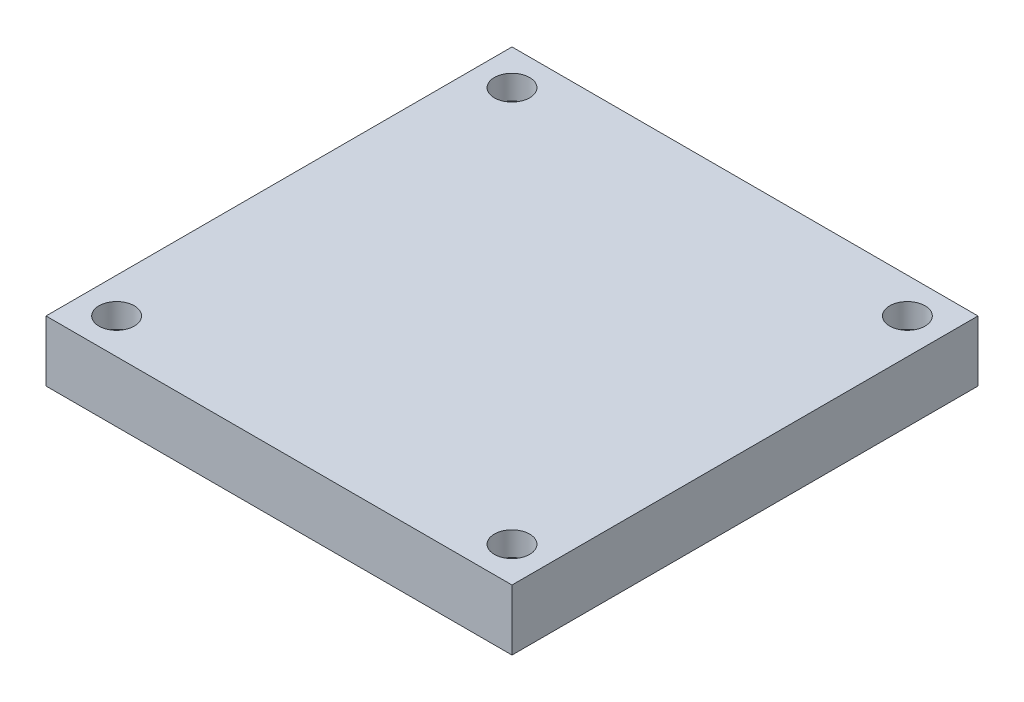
ISO-10303-21;
HEADER;
FILE_DESCRIPTION(('STEP AP214'),'2;1');
FILE_NAME('part.step','',(''),(''),'','','');
FILE_SCHEMA(('AUTOMOTIVE_DESIGN { 1 0 10303 214 1 1 1 1 }'));
ENDSEC;
DATA;
#1=APPLICATION_CONTEXT('core data for automotive mechanical design processes');
#2=APPLICATION_PROTOCOL_DEFINITION('international standard','automotive_design',2000,#1);
#3=PRODUCT_CONTEXT('',#1,'mechanical');
#4=PRODUCT('Part','Part','',(#3));
#5=PRODUCT_RELATED_PRODUCT_CATEGORY('part','',(#4));
#6=PRODUCT_DEFINITION_FORMATION('','',#4);
#7=PRODUCT_DEFINITION_CONTEXT('part definition',#1,'design');
#8=PRODUCT_DEFINITION('design','',#6,#7);
#9=PRODUCT_DEFINITION_SHAPE('','',#8);
#10=(LENGTH_UNIT() NAMED_UNIT(*) SI_UNIT(.MILLI.,.METRE.));
#11=(NAMED_UNIT(*) PLANE_ANGLE_UNIT() SI_UNIT($,.RADIAN.));
#12=(NAMED_UNIT(*) SI_UNIT($,.STERADIAN.) SOLID_ANGLE_UNIT());
#13=UNCERTAINTY_MEASURE_WITH_UNIT(LENGTH_MEASURE(1.E-05),#10,'distance_accuracy_value','');
#14=(GEOMETRIC_REPRESENTATION_CONTEXT(3) GLOBAL_UNCERTAINTY_ASSIGNED_CONTEXT((#13)) GLOBAL_UNIT_ASSIGNED_CONTEXT((#10,
#11,#12)) REPRESENTATION_CONTEXT('',''));
#15=CARTESIAN_POINT('',(0.,0.,0.));
#16=DIRECTION('',(0.,0.,1.));
#17=DIRECTION('',(1.,0.,0.));
#18=AXIS2_PLACEMENT_3D('',#15,#16,#17);
#19=CARTESIAN_POINT('',(0.,4.3,0.));
#20=DIRECTION('',(1.,0.,0.));
#21=DIRECTION('',(0.,0.,-1.));
#22=AXIS2_PLACEMENT_3D('',#19,#20,#21);
#23=PLANE('',#22);
#24=DIRECTION('',(0.,0.,1.));
#25=VECTOR('',#24,1.);
#26=CARTESIAN_POINT('',(0.,0.,0.));
#27=LINE('',#26,#25);
#28=CARTESIAN_POINT('',(0.,0.,0.));
#29=VERTEX_POINT('',#28);
#30=CARTESIAN_POINT('',(0.,0.,33.));
#31=VERTEX_POINT('',#30);
#32=EDGE_CURVE('E100',#29,#31,#27,.T.);
#33=ORIENTED_EDGE('',*,*,#32,.T.);
#34=DIRECTION('',(0.,-1.,0.));
#35=VECTOR('',#34,1.);
#36=CARTESIAN_POINT('',(0.,4.3,33.));
#37=LINE('',#36,#35);
#38=CARTESIAN_POINT('',(0.,4.3,33.));
#39=VERTEX_POINT('',#38);
#40=EDGE_CURVE('E11',#39,#31,#37,.T.);
#41=ORIENTED_EDGE('',*,*,#40,.F.);
#42=DIRECTION('',(0.,0.,1.));
#43=VECTOR('',#42,1.);
#44=CARTESIAN_POINT('',(0.,4.3,0.));
#45=LINE('',#44,#43);
#46=CARTESIAN_POINT('',(0.,4.3,0.));
#47=VERTEX_POINT('',#46);
#48=EDGE_CURVE('E88',#47,#39,#45,.T.);
#49=ORIENTED_EDGE('',*,*,#48,.F.);
#50=DIRECTION('',(0.,-1.,0.));
#51=VECTOR('',#50,1.);
#52=CARTESIAN_POINT('',(0.,4.3,0.));
#53=LINE('',#52,#51);
#54=EDGE_CURVE('E96',#47,#29,#53,.T.);
#55=ORIENTED_EDGE('',*,*,#54,.T.);
#56=EDGE_LOOP('',(#33,#41,#49,#55));
#57=FACE_BOUND('',#56,.T.);
#58=ADVANCED_FACE('F37',(#57),#23,.F.);
#59=CARTESIAN_POINT('',(0.,4.3,33.));
#60=DIRECTION('',(0.,0.,-1.));
#61=DIRECTION('',(-1.,0.,0.));
#62=AXIS2_PLACEMENT_3D('',#59,#60,#61);
#63=PLANE('',#62);
#64=DIRECTION('',(1.,0.,0.));
#65=VECTOR('',#64,1.);
#66=CARTESIAN_POINT('',(0.,0.,33.));
#67=LINE('',#66,#65);
#68=CARTESIAN_POINT('',(33.,0.,33.));
#69=VERTEX_POINT('',#68);
#70=EDGE_CURVE('E92',#31,#69,#67,.T.);
#71=ORIENTED_EDGE('',*,*,#70,.T.);
#72=DIRECTION('',(0.,-1.,0.));
#73=VECTOR('',#72,1.);
#74=CARTESIAN_POINT('',(33.,4.3,33.));
#75=LINE('',#74,#73);
#76=CARTESIAN_POINT('',(33.,4.3,33.));
#77=VERTEX_POINT('',#76);
#78=EDGE_CURVE('E45',#77,#69,#75,.T.);
#79=ORIENTED_EDGE('',*,*,#78,.F.);
#80=DIRECTION('',(1.,0.,0.));
#81=VECTOR('',#80,1.);
#82=CARTESIAN_POINT('',(0.,4.3,33.));
#83=LINE('',#82,#81);
#84=EDGE_CURVE('E83',#39,#77,#83,.T.);
#85=ORIENTED_EDGE('',*,*,#84,.F.);
#86=ORIENTED_EDGE('',*,*,#40,.T.);
#87=EDGE_LOOP('',(#71,#79,#85,#86));
#88=FACE_BOUND('',#87,.T.);
#89=ADVANCED_FACE('F91',(#88),#63,.F.);
#90=CARTESIAN_POINT('',(33.,4.3,0.));
#91=DIRECTION('',(-1.,0.,0.));
#92=DIRECTION('',(0.,0.,1.));
#93=AXIS2_PLACEMENT_3D('',#90,#91,#92);
#94=PLANE('',#93);
#95=DIRECTION('',(0.,0.,-1.));
#96=VECTOR('',#95,1.);
#97=CARTESIAN_POINT('',(33.,0.,0.));
#98=LINE('',#97,#96);
#99=CARTESIAN_POINT('',(33.,0.,0.));
#100=VERTEX_POINT('',#99);
#101=EDGE_CURVE('E70',#69,#100,#98,.T.);
#102=ORIENTED_EDGE('',*,*,#101,.T.);
#103=DIRECTION('',(0.,-1.,0.));
#104=VECTOR('',#103,1.);
#105=CARTESIAN_POINT('',(33.,4.3,0.));
#106=LINE('',#105,#104);
#107=CARTESIAN_POINT('',(33.,4.3,0.));
#108=VERTEX_POINT('',#107);
#109=EDGE_CURVE('E93',#108,#100,#106,.T.);
#110=ORIENTED_EDGE('',*,*,#109,.F.);
#111=DIRECTION('',(0.,0.,-1.));
#112=VECTOR('',#111,1.);
#113=CARTESIAN_POINT('',(33.,4.3,0.));
#114=LINE('',#113,#112);
#115=EDGE_CURVE('E86',#77,#108,#114,.T.);
#116=ORIENTED_EDGE('',*,*,#115,.F.);
#117=ORIENTED_EDGE('',*,*,#78,.T.);
#118=EDGE_LOOP('',(#102,#110,#116,#117));
#119=FACE_BOUND('',#118,.T.);
#120=ADVANCED_FACE('F94',(#119),#94,.F.);
#121=CARTESIAN_POINT('',(0.,4.3,0.));
#122=DIRECTION('',(0.,0.,1.));
#123=DIRECTION('',(1.,0.,0.));
#124=AXIS2_PLACEMENT_3D('',#121,#122,#123);
#125=PLANE('',#124);
#126=DIRECTION('',(-1.,0.,0.));
#127=VECTOR('',#126,1.);
#128=CARTESIAN_POINT('',(0.,0.,0.));
#129=LINE('',#128,#127);
#130=EDGE_CURVE('E76',#100,#29,#129,.T.);
#131=ORIENTED_EDGE('',*,*,#130,.T.);
#132=ORIENTED_EDGE('',*,*,#54,.F.);
#133=DIRECTION('',(-1.,0.,0.));
#134=VECTOR('',#133,1.);
#135=CARTESIAN_POINT('',(0.,4.3,0.));
#136=LINE('',#135,#134);
#137=EDGE_CURVE('E53',#108,#47,#136,.T.);
#138=ORIENTED_EDGE('',*,*,#137,.F.);
#139=ORIENTED_EDGE('',*,*,#109,.T.);
#140=EDGE_LOOP('',(#131,#132,#138,#139));
#141=FACE_BOUND('',#140,.T.);
#142=ADVANCED_FACE('F108',(#141),#125,.F.);
#143=CARTESIAN_POINT('',(0.,4.3,33.));
#144=DIRECTION('',(0.,1.,0.));
#145=DIRECTION('',(0.,0.,1.));
#146=AXIS2_PLACEMENT_3D('',#143,#144,#145);
#147=PLANE('',#146);
#148=CARTESIAN_POINT('',(30.5,4.3,30.5));
#149=DIRECTION('',(0.,-1.,0.));
#150=DIRECTION('',(0.,0.,-1.));
#151=AXIS2_PLACEMENT_3D('',#148,#149,#150);
#152=CIRCLE('',#151,1.25);
#153=CARTESIAN_POINT('',(30.5,4.3,29.25));
#154=VERTEX_POINT('',#153);
#155=EDGE_CURVE('E149',#154,#154,#152,.T.);
#156=ORIENTED_EDGE('',*,*,#155,.T.);
#157=EDGE_LOOP('',(#156));
#158=FACE_BOUND('',#157,.T.);
#159=CARTESIAN_POINT('',(2.50000000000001,4.3,30.5));
#160=DIRECTION('',(0.,-1.,0.));
#161=DIRECTION('',(0.,0.,-1.));
#162=AXIS2_PLACEMENT_3D('',#159,#160,#161);
#163=CIRCLE('',#162,1.25);
#164=CARTESIAN_POINT('',(2.50000000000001,4.3,29.25));
#165=VERTEX_POINT('',#164);
#166=EDGE_CURVE('E137',#165,#165,#163,.T.);
#167=ORIENTED_EDGE('',*,*,#166,.T.);
#168=EDGE_LOOP('',(#167));
#169=FACE_BOUND('',#168,.T.);
#170=CARTESIAN_POINT('',(2.5,4.3,2.50000000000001));
#171=DIRECTION('',(0.,-1.,0.));
#172=DIRECTION('',(0.,0.,-1.));
#173=AXIS2_PLACEMENT_3D('',#170,#171,#172);
#174=CIRCLE('',#173,1.25);
#175=CARTESIAN_POINT('',(2.5,4.3,1.25000000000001));
#176=VERTEX_POINT('',#175);
#177=EDGE_CURVE('E125',#176,#176,#174,.T.);
#178=ORIENTED_EDGE('',*,*,#177,.T.);
#179=EDGE_LOOP('',(#178));
#180=FACE_BOUND('',#179,.T.);
#181=CARTESIAN_POINT('',(30.5,4.3,2.5));
#182=DIRECTION('',(0.,-1.,0.));
#183=DIRECTION('',(0.,0.,-1.));
#184=AXIS2_PLACEMENT_3D('',#181,#182,#183);
#185=CIRCLE('',#184,1.25);
#186=CARTESIAN_POINT('',(30.5,4.3,1.25));
#187=VERTEX_POINT('',#186);
#188=EDGE_CURVE('E103',#187,#187,#185,.T.);
#189=ORIENTED_EDGE('',*,*,#188,.T.);
#190=EDGE_LOOP('',(#189));
#191=FACE_BOUND('',#190,.T.);
#192=ORIENTED_EDGE('',*,*,#48,.T.);
#193=ORIENTED_EDGE('',*,*,#84,.T.);
#194=ORIENTED_EDGE('',*,*,#115,.T.);
#195=ORIENTED_EDGE('',*,*,#137,.T.);
#196=EDGE_LOOP('',(#192,#193,#194,#195));
#197=FACE_BOUND('',#196,.T.);
#198=ADVANCED_FACE('F84',(#158,#169,#180,#191,#197),#147,.T.);
#199=CARTESIAN_POINT('',(0.,0.,33.));
#200=DIRECTION('',(0.,1.,0.));
#201=DIRECTION('',(0.,0.,1.));
#202=AXIS2_PLACEMENT_3D('',#199,#200,#201);
#203=PLANE('',#202);
#204=CARTESIAN_POINT('',(30.5,0.,30.5));
#205=DIRECTION('',(0.,-1.,0.));
#206=DIRECTION('',(0.,0.,-1.));
#207=AXIS2_PLACEMENT_3D('',#204,#205,#206);
#208=CIRCLE('',#207,2.1);
#209=CARTESIAN_POINT('',(30.5,0.,28.4));
#210=VERTEX_POINT('',#209);
#211=EDGE_CURVE('E158',#210,#210,#208,.T.);
#212=ORIENTED_EDGE('',*,*,#211,.F.);
#213=EDGE_LOOP('',(#212));
#214=FACE_BOUND('',#213,.T.);
#215=CARTESIAN_POINT('',(2.50000000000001,0.,30.5));
#216=DIRECTION('',(0.,-1.,0.));
#217=DIRECTION('',(0.,0.,-1.));
#218=AXIS2_PLACEMENT_3D('',#215,#216,#217);
#219=CIRCLE('',#218,2.1);
#220=CARTESIAN_POINT('',(2.50000000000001,0.,28.4));
#221=VERTEX_POINT('',#220);
#222=EDGE_CURVE('E146',#221,#221,#219,.T.);
#223=ORIENTED_EDGE('',*,*,#222,.F.);
#224=EDGE_LOOP('',(#223));
#225=FACE_BOUND('',#224,.T.);
#226=CARTESIAN_POINT('',(2.5,0.,2.50000000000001));
#227=DIRECTION('',(0.,-1.,0.));
#228=DIRECTION('',(0.,0.,-1.));
#229=AXIS2_PLACEMENT_3D('',#226,#227,#228);
#230=CIRCLE('',#229,2.1);
#231=CARTESIAN_POINT('',(2.5,0.,0.400000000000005));
#232=VERTEX_POINT('',#231);
#233=EDGE_CURVE('E134',#232,#232,#230,.T.);
#234=ORIENTED_EDGE('',*,*,#233,.F.);
#235=EDGE_LOOP('',(#234));
#236=FACE_BOUND('',#235,.T.);
#237=CARTESIAN_POINT('',(30.5,0.,2.5));
#238=DIRECTION('',(0.,-1.,0.));
#239=DIRECTION('',(0.,0.,-1.));
#240=AXIS2_PLACEMENT_3D('',#237,#238,#239);
#241=CIRCLE('',#240,2.1);
#242=CARTESIAN_POINT('',(30.5,0.,0.400000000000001));
#243=VERTEX_POINT('',#242);
#244=EDGE_CURVE('E122',#243,#243,#241,.T.);
#245=ORIENTED_EDGE('',*,*,#244,.F.);
#246=EDGE_LOOP('',(#245));
#247=FACE_BOUND('',#246,.T.);
#248=ORIENTED_EDGE('',*,*,#32,.F.);
#249=ORIENTED_EDGE('',*,*,#130,.F.);
#250=ORIENTED_EDGE('',*,*,#101,.F.);
#251=ORIENTED_EDGE('',*,*,#70,.F.);
#252=EDGE_LOOP('',(#248,#249,#250,#251));
#253=FACE_BOUND('',#252,.T.);
#254=ADVANCED_FACE('F111',(#214,#225,#236,#247,#253),#203,.F.);
#255=CARTESIAN_POINT('',(30.5,0.,2.5));
#256=DIRECTION('',(0.,-1.,0.));
#257=DIRECTION('',(0.,0.,-1.));
#258=AXIS2_PLACEMENT_3D('',#255,#256,#257);
#259=CYLINDRICAL_SURFACE('',#258,1.25);
#260=ORIENTED_EDGE('',*,*,#188,.F.);
#261=EDGE_LOOP('',(#260));
#262=FACE_BOUND('',#261,.T.);
#263=CARTESIAN_POINT('',(30.5,2.6,2.5));
#264=DIRECTION('',(0.,-1.,0.));
#265=DIRECTION('',(0.,0.,-1.));
#266=AXIS2_PLACEMENT_3D('',#263,#264,#265);
#267=CIRCLE('',#266,1.25);
#268=CARTESIAN_POINT('',(30.5,2.6,1.25));
#269=VERTEX_POINT('',#268);
#270=EDGE_CURVE('E116',#269,#269,#267,.T.);
#271=ORIENTED_EDGE('',*,*,#270,.T.);
#272=EDGE_LOOP('',(#271));
#273=FACE_BOUND('',#272,.T.);
#274=ADVANCED_FACE('F166',(#262,#273),#259,.F.);
#275=CARTESIAN_POINT('',(31.75,2.6,2.5));
#276=DIRECTION('',(0.,1.,0.));
#277=DIRECTION('',(0.,0.,1.));
#278=AXIS2_PLACEMENT_3D('',#275,#276,#277);
#279=PLANE('',#278);
#280=ORIENTED_EDGE('',*,*,#270,.F.);
#281=EDGE_LOOP('',(#280));
#282=FACE_BOUND('',#281,.T.);
#283=CARTESIAN_POINT('',(30.5,2.6,2.5));
#284=DIRECTION('',(0.,-1.,0.));
#285=DIRECTION('',(0.,0.,-1.));
#286=AXIS2_PLACEMENT_3D('',#283,#284,#285);
#287=CIRCLE('',#286,2.1);
#288=CARTESIAN_POINT('',(30.5,2.6,0.400000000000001));
#289=VERTEX_POINT('',#288);
#290=EDGE_CURVE('E119',#289,#289,#287,.T.);
#291=ORIENTED_EDGE('',*,*,#290,.T.);
#292=EDGE_LOOP('',(#291));
#293=FACE_BOUND('',#292,.T.);
#294=ADVANCED_FACE('F177',(#282,#293),#279,.F.);
#295=CARTESIAN_POINT('',(30.5,0.,2.5));
#296=DIRECTION('',(0.,-1.,0.));
#297=DIRECTION('',(0.,0.,-1.));
#298=AXIS2_PLACEMENT_3D('',#295,#296,#297);
#299=CYLINDRICAL_SURFACE('',#298,2.1);
#300=ORIENTED_EDGE('',*,*,#290,.F.);
#301=EDGE_LOOP('',(#300));
#302=FACE_BOUND('',#301,.T.);
#303=ORIENTED_EDGE('',*,*,#244,.T.);
#304=EDGE_LOOP('',(#303));
#305=FACE_BOUND('',#304,.T.);
#306=ADVANCED_FACE('F174',(#302,#305),#299,.F.);
#307=CARTESIAN_POINT('',(2.5,0.,2.50000000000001));
#308=DIRECTION('',(0.,-1.,0.));
#309=DIRECTION('',(0.,0.,-1.));
#310=AXIS2_PLACEMENT_3D('',#307,#308,#309);
#311=CYLINDRICAL_SURFACE('',#310,1.25);
#312=ORIENTED_EDGE('',*,*,#177,.F.);
#313=EDGE_LOOP('',(#312));
#314=FACE_BOUND('',#313,.T.);
#315=CARTESIAN_POINT('',(2.5,2.6,2.50000000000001));
#316=DIRECTION('',(0.,-1.,0.));
#317=DIRECTION('',(0.,0.,-1.));
#318=AXIS2_PLACEMENT_3D('',#315,#316,#317);
#319=CIRCLE('',#318,1.25);
#320=CARTESIAN_POINT('',(2.5,2.6,1.25000000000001));
#321=VERTEX_POINT('',#320);
#322=EDGE_CURVE('E128',#321,#321,#319,.T.);
#323=ORIENTED_EDGE('',*,*,#322,.T.);
#324=EDGE_LOOP('',(#323));
#325=FACE_BOUND('',#324,.T.);
#326=ADVANCED_FACE('F176',(#314,#325),#311,.F.);
#327=CARTESIAN_POINT('',(3.75,2.6,2.50000000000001));
#328=DIRECTION('',(0.,1.,0.));
#329=DIRECTION('',(0.,0.,1.));
#330=AXIS2_PLACEMENT_3D('',#327,#328,#329);
#331=PLANE('',#330);
#332=ORIENTED_EDGE('',*,*,#322,.F.);
#333=EDGE_LOOP('',(#332));
#334=FACE_BOUND('',#333,.T.);
#335=CARTESIAN_POINT('',(2.5,2.6,2.50000000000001));
#336=DIRECTION('',(0.,-1.,0.));
#337=DIRECTION('',(0.,0.,-1.));
#338=AXIS2_PLACEMENT_3D('',#335,#336,#337);
#339=CIRCLE('',#338,2.1);
#340=CARTESIAN_POINT('',(2.5,2.6,0.400000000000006));
#341=VERTEX_POINT('',#340);
#342=EDGE_CURVE('E131',#341,#341,#339,.T.);
#343=ORIENTED_EDGE('',*,*,#342,.T.);
#344=EDGE_LOOP('',(#343));
#345=FACE_BOUND('',#344,.T.);
#346=ADVANCED_FACE('F184',(#334,#345),#331,.F.);
#347=CARTESIAN_POINT('',(2.5,0.,2.50000000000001));
#348=DIRECTION('',(0.,-1.,0.));
#349=DIRECTION('',(0.,0.,-1.));
#350=AXIS2_PLACEMENT_3D('',#347,#348,#349);
#351=CYLINDRICAL_SURFACE('',#350,2.1);
#352=ORIENTED_EDGE('',*,*,#342,.F.);
#353=EDGE_LOOP('',(#352));
#354=FACE_BOUND('',#353,.T.);
#355=ORIENTED_EDGE('',*,*,#233,.T.);
#356=EDGE_LOOP('',(#355));
#357=FACE_BOUND('',#356,.T.);
#358=ADVANCED_FACE('F238',(#354,#357),#351,.F.);
#359=CARTESIAN_POINT('',(2.50000000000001,0.,30.5));
#360=DIRECTION('',(0.,-1.,0.));
#361=DIRECTION('',(0.,0.,-1.));
#362=AXIS2_PLACEMENT_3D('',#359,#360,#361);
#363=CYLINDRICAL_SURFACE('',#362,1.25);
#364=ORIENTED_EDGE('',*,*,#166,.F.);
#365=EDGE_LOOP('',(#364));
#366=FACE_BOUND('',#365,.T.);
#367=CARTESIAN_POINT('',(2.50000000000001,2.6,30.5));
#368=DIRECTION('',(0.,-1.,0.));
#369=DIRECTION('',(0.,0.,-1.));
#370=AXIS2_PLACEMENT_3D('',#367,#368,#369);
#371=CIRCLE('',#370,1.25);
#372=CARTESIAN_POINT('',(2.50000000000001,2.6,29.25));
#373=VERTEX_POINT('',#372);
#374=EDGE_CURVE('E140',#373,#373,#371,.T.);
#375=ORIENTED_EDGE('',*,*,#374,.T.);
#376=EDGE_LOOP('',(#375));
#377=FACE_BOUND('',#376,.T.);
#378=ADVANCED_FACE('F248',(#366,#377),#363,.F.);
#379=CARTESIAN_POINT('',(3.75,2.6,30.5));
#380=DIRECTION('',(0.,1.,0.));
#381=DIRECTION('',(0.,0.,1.));
#382=AXIS2_PLACEMENT_3D('',#379,#380,#381);
#383=PLANE('',#382);
#384=ORIENTED_EDGE('',*,*,#374,.F.);
#385=EDGE_LOOP('',(#384));
#386=FACE_BOUND('',#385,.T.);
#387=CARTESIAN_POINT('',(2.50000000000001,2.6,30.5));
#388=DIRECTION('',(0.,-1.,0.));
#389=DIRECTION('',(0.,0.,-1.));
#390=AXIS2_PLACEMENT_3D('',#387,#388,#389);
#391=CIRCLE('',#390,2.1);
#392=CARTESIAN_POINT('',(2.50000000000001,2.6,28.4));
#393=VERTEX_POINT('',#392);
#394=EDGE_CURVE('E143',#393,#393,#391,.T.);
#395=ORIENTED_EDGE('',*,*,#394,.T.);
#396=EDGE_LOOP('',(#395));
#397=FACE_BOUND('',#396,.T.);
#398=ADVANCED_FACE('F258',(#386,#397),#383,.F.);
#399=CARTESIAN_POINT('',(2.50000000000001,0.,30.5));
#400=DIRECTION('',(0.,-1.,0.));
#401=DIRECTION('',(0.,0.,-1.));
#402=AXIS2_PLACEMENT_3D('',#399,#400,#401);
#403=CYLINDRICAL_SURFACE('',#402,2.1);
#404=ORIENTED_EDGE('',*,*,#394,.F.);
#405=EDGE_LOOP('',(#404));
#406=FACE_BOUND('',#405,.T.);
#407=ORIENTED_EDGE('',*,*,#222,.T.);
#408=EDGE_LOOP('',(#407));
#409=FACE_BOUND('',#408,.T.);
#410=ADVANCED_FACE('F268',(#406,#409),#403,.F.);
#411=CARTESIAN_POINT('',(30.5,0.,30.5));
#412=DIRECTION('',(0.,-1.,0.));
#413=DIRECTION('',(0.,0.,-1.));
#414=AXIS2_PLACEMENT_3D('',#411,#412,#413);
#415=CYLINDRICAL_SURFACE('',#414,1.25);
#416=ORIENTED_EDGE('',*,*,#155,.F.);
#417=EDGE_LOOP('',(#416));
#418=FACE_BOUND('',#417,.T.);
#419=CARTESIAN_POINT('',(30.5,2.6,30.5));
#420=DIRECTION('',(0.,-1.,0.));
#421=DIRECTION('',(0.,0.,-1.));
#422=AXIS2_PLACEMENT_3D('',#419,#420,#421);
#423=CIRCLE('',#422,1.25);
#424=CARTESIAN_POINT('',(30.5,2.6,29.25));
#425=VERTEX_POINT('',#424);
#426=EDGE_CURVE('E152',#425,#425,#423,.T.);
#427=ORIENTED_EDGE('',*,*,#426,.T.);
#428=EDGE_LOOP('',(#427));
#429=FACE_BOUND('',#428,.T.);
#430=ADVANCED_FACE('F278',(#418,#429),#415,.F.);
#431=CARTESIAN_POINT('',(31.75,2.6,30.5));
#432=DIRECTION('',(0.,1.,0.));
#433=DIRECTION('',(0.,0.,1.));
#434=AXIS2_PLACEMENT_3D('',#431,#432,#433);
#435=PLANE('',#434);
#436=ORIENTED_EDGE('',*,*,#426,.F.);
#437=EDGE_LOOP('',(#436));
#438=FACE_BOUND('',#437,.T.);
#439=CARTESIAN_POINT('',(30.5,2.6,30.5));
#440=DIRECTION('',(0.,-1.,0.));
#441=DIRECTION('',(0.,0.,-1.));
#442=AXIS2_PLACEMENT_3D('',#439,#440,#441);
#443=CIRCLE('',#442,2.1);
#444=CARTESIAN_POINT('',(30.5,2.6,28.4));
#445=VERTEX_POINT('',#444);
#446=EDGE_CURVE('E155',#445,#445,#443,.T.);
#447=ORIENTED_EDGE('',*,*,#446,.T.);
#448=EDGE_LOOP('',(#447));
#449=FACE_BOUND('',#448,.T.);
#450=ADVANCED_FACE('F288',(#438,#449),#435,.F.);
#451=CARTESIAN_POINT('',(30.5,0.,30.5));
#452=DIRECTION('',(0.,-1.,0.));
#453=DIRECTION('',(0.,0.,-1.));
#454=AXIS2_PLACEMENT_3D('',#451,#452,#453);
#455=CYLINDRICAL_SURFACE('',#454,2.1);
#456=ORIENTED_EDGE('',*,*,#446,.F.);
#457=EDGE_LOOP('',(#456));
#458=FACE_BOUND('',#457,.T.);
#459=ORIENTED_EDGE('',*,*,#211,.T.);
#460=EDGE_LOOP('',(#459));
#461=FACE_BOUND('',#460,.T.);
#462=ADVANCED_FACE('F162',(#458,#461),#455,.F.);
#463=CLOSED_SHELL('',(#58,#89,#120,#142,#198,#254,#274,#294,#306,#326,#346,#358,#378,#398,#410,
#430,#450,#462));
#464=MANIFOLD_SOLID_BREP('B2',#463);
#465=ADVANCED_BREP_SHAPE_REPRESENTATION('',(#18,#464),#14);
#466=SHAPE_DEFINITION_REPRESENTATION(#9,#465);
ENDSEC;
END-ISO-10303-21;
